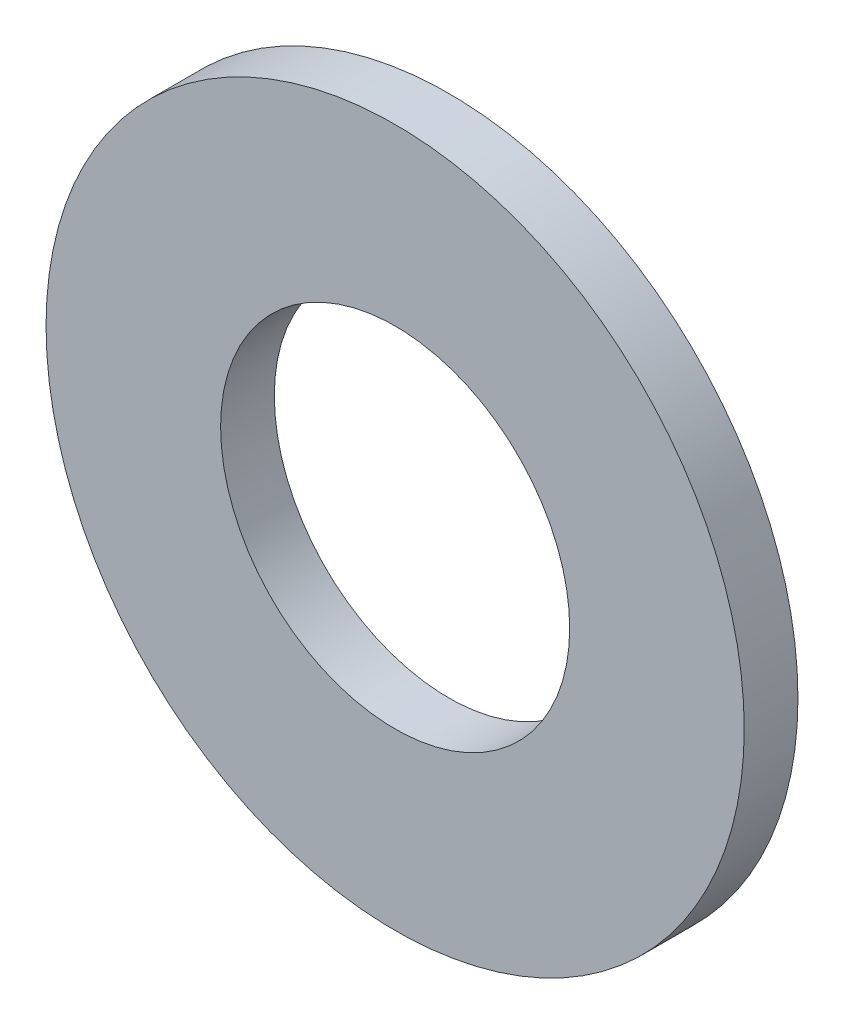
from build123d import *

# Parameters (mm, degrees)
ESQUISSE1_R             = 6.5
BASE_EXTRUSION_DEPTH    = 1
ESQUISSE2_R             = 3.25
ENL_V_MAT_EXTRU_1_DEPTH = 1


with BuildPart() as part:
    # Esquisse1 → Base-Extrusion (new body)
    with BuildSketch(Plane.XY):
        Circle(ESQUISSE1_R)
    extrude(amount=BASE_EXTRUSION_DEPTH)

    # Esquisse2 → Enl_v. mat.-Extru.1 (cut)
    with BuildSketch(Plane(origin=(0, 0, 0), x_dir=(-1, 0, 0), z_dir=(0, 0, -1))):
        Circle(ESQUISSE2_R)
    extrude(amount=-ENL_V_MAT_EXTRU_1_DEPTH, mode=Mode.SUBTRACT)


solid = part.part
